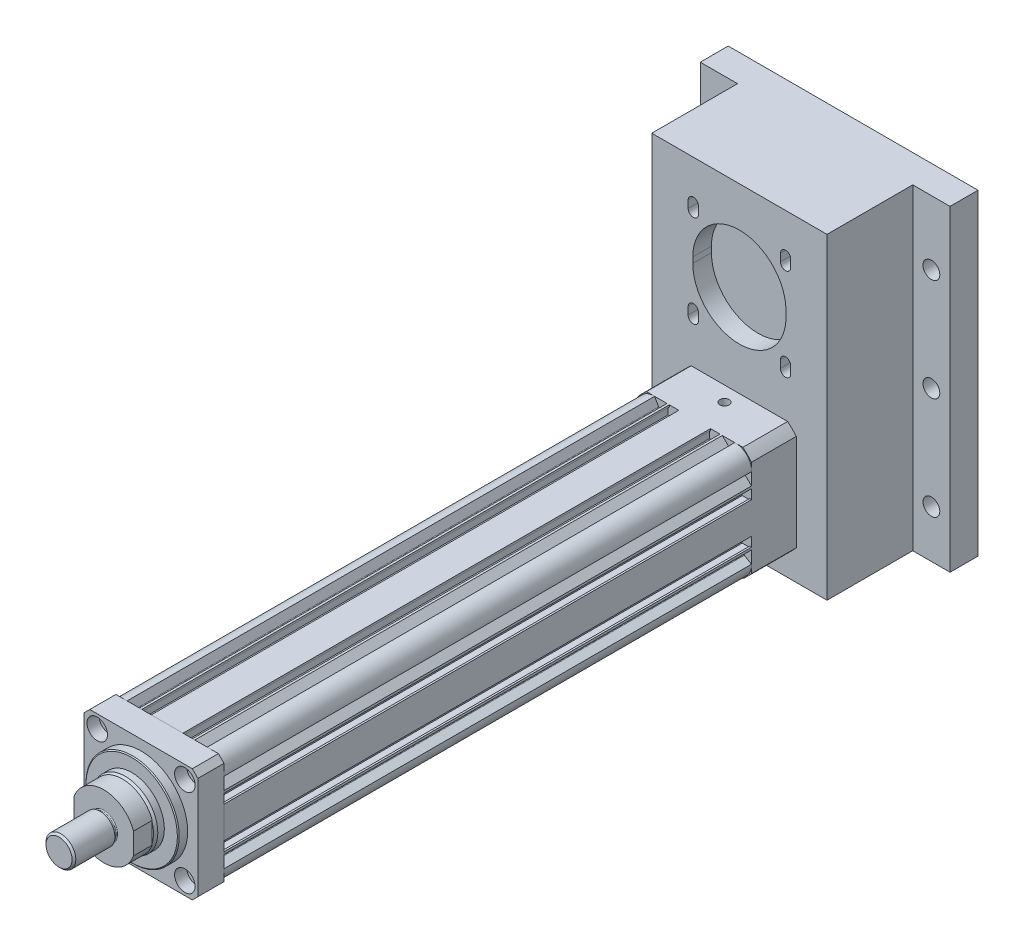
from build123d import *

# Parameters (mm, degrees)
SKETCH_1_R           = 25
SKETCH_1_R_2         = 2.594
EXTRUDE_1_DEPTH      = 283
EXTRUDE_1_2_DEPTH    = 14
SKETCH_3_R           = 4.5
SKETCH_3_R_2         = 3.5
CUT_EXTRUDE_3_DEPTH  = 14
SKETCH_3_5_R         = 5.5
CUT_EXTRUDE_4_DEPTH  = 6.5
SKETCH_5_R           = 25
EXTRUDE_2_DEPTH      = 5
CHAMFER_1_SIZE       = 0.5
SKETCH_6_R           = 17.5
EXTRUDE_3_DEPTH      = 5
CHAMFER_2_SIZE       = 1.5
CHAMFER_2_SIZE2      = 0.8
EXTRUDE_4_DEPTH      = 10
SKETCH_8_R           = 7
EXTRUDE_5_DEPTH      = 2
SKETCH_9_R           = 8
EXTRUDE_6_DEPTH      = 22
CHAMFER_3_SIZE       = 1
FILLET_1_R           = 0.5
SKETCH_10_W          = 61
SKETCH_10_H          = 61
EXTRUDE_7_DEPTH      = 24
SKETCH_11_R          = 50
SKETCH_11_R_2        = 40
CUT_EXTRUDE_1_DEPTH  = 24
SKETCH_26_W          = 94
SKETCH_26_H          = 170
EXTRUDE_11_DEPTH     = 46
CUT_EXTRUDE_11_DEPTH = 10
CUT_EXTRUDE_12_DEPTH = 10
CUT_EXTRUDE_START    = -10
CUT_EXTRUDE_13_DEPTH = 5
SKETCH_28_W          = 134
SKETCH_28_H          = 170
SKETCH_28_R          = 4.5
EXTRUDE_12_DEPTH     = 15


with BuildPart() as part:
    # Sketch 1 → Extrude 1 (new body)
    with BuildSketch(Plane.XY):
        with BuildLine():
            Line((30.5, 8.5), (29.5, 8.5))
            Line((29.5, 8.5), (29.5, 7.9))
            Line((29.5, 7.9), (25.5, 7.9))
            Line((25.5, 7.9), (25.5, 14.2))
            Line((25.5, 14.2), (29.5, 14.2))
            Line((29.5, 14.2), (29.5, 13.6))
            Line((29.5, 13.6), (30.5, 13.6))
            Line((30.5, 13.6), (30.5, 14.843551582))
            Line((30.5, 14.843551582), (26.602512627, 18.741038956))
            ThreePointArc((26.602512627, 18.741038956), (26.502994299, 19.034210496), (26.675, 19.29163522))
            Line((26.675, 19.29163522), (30.5, 21.5))
            ThreePointArc((30.5, 21.5), (28.010599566, 28.010599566), (21.5, 30.5))
            Line((21.5, 30.5), (19.29163522, 26.675))
            ThreePointArc((19.29163522, 26.675), (19.034210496, 26.502994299), (18.741038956, 26.602512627))
            Line((18.741038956, 26.602512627), (14.843551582, 30.5))
            Line((14.843551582, 30.5), (13.6, 30.5))
            Line((13.6, 30.5), (13.6, 29.5))
            Line((13.6, 29.5), (14.2, 29.5))
            Line((14.2, 29.5), (14.2, 25.5))
            Line((14.2, 25.5), (7.9, 25.5))
            Line((7.9, 25.5), (7.9, 29.5))
            Line((7.9, 29.5), (8.5, 29.5))
            Line((8.5, 29.5), (8.5, 30.5))
            Line((8.5, 30.5), (-8.5, 30.5))
            Line((-8.5, 30.5), (-8.5, 29.5))
            Line((-8.5, 29.5), (-7.9, 29.5))
            Line((-7.9, 29.5), (-7.9, 25.5))
            Line((-7.9, 25.5), (-14.2, 25.5))
            Line((-14.2, 25.5), (-14.2, 29.5))
            Line((-14.2, 29.5), (-13.6, 29.5))
            Line((-13.6, 29.5), (-13.6, 30.5))
            Line((-13.6, 30.5), (-14.843551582, 30.5))
            Line((-14.843551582, 30.5), (-18.741038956, 26.602512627))
            ThreePointArc((-18.741038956, 26.602512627), (-19.034210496, 26.502994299), (-19.29163522, 26.675))
            Line((-19.29163522, 26.675), (-21.5, 30.5))
            ThreePointArc((-21.5, 30.5), (-28.010599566, 28.010599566), (-30.5, 21.5))
            Line((-30.5, 21.5), (-26.675, 19.29163522))
            ThreePointArc((-26.675, 19.29163522), (-26.502994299, 19.034210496), (-26.602512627, 18.741038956))
            Line((-26.602512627, 18.741038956), (-30.5, 14.843551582))
            Line((-30.5, 14.843551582), (-30.5, 13.6))
            Line((-30.5, 13.6), (-29.5, 13.6))
            Line((-29.5, 13.6), (-29.5, 14.2))
            Line((-29.5, 14.2), (-25.5, 14.2))
            Line((-25.5, 14.2), (-25.5, 7.9))
            Line((-25.5, 7.9), (-29.5, 7.9))
            Line((-29.5, 7.9), (-29.5, 8.5))
            Line((-29.5, 8.5), (-30.5, 8.5))
            Line((-30.5, 8.5), (-30.5, -8.5))
            Line((-30.5, -8.5), (-29.5, -8.5))
            Line((-29.5, -8.5), (-29.5, -7.9))
            Line((-29.5, -7.9), (-25.5, -7.9))
            Line((-25.5, -7.9), (-25.5, -14.2))
            Line((-25.5, -14.2), (-29.5, -14.2))
            Line((-29.5, -14.2), (-29.5, -13.6))
            Line((-29.5, -13.6), (-30.5, -13.6))
            Line((-30.5, -13.6), (-30.5, -14.843551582))
            Line((-30.5, -14.843551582), (-26.602512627, -18.741038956))
            ThreePointArc((-26.602512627, -18.741038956), (-26.502994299, -19.034210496), (-26.675, -19.29163522))
            Line((-26.675, -19.29163522), (-30.5, -21.5))
            ThreePointArc((-30.5, -21.5), (-27.825897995, -28.191225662), (-21, -30.5))
            Line((-21, -30.5), (-18.79163522, -26.675))
            ThreePointArc((-18.79163522, -26.675), (-18.534210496, -26.502994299), (-18.241038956, -26.602512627))
            Line((-18.241038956, -26.602512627), (-14.343551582, -30.5))
            Line((-14.343551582, -30.5), (14.343551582, -30.5))
            Line((14.343551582, -30.5), (18.241038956, -26.602512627))
            ThreePointArc((18.241038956, -26.602512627), (18.534210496, -26.502994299), (18.79163522, -26.675))
            Line((18.79163522, -26.675), (21, -30.5))
            ThreePointArc((21, -30.5), (27.825897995, -28.191225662), (30.5, -21.5))
            Line((30.5, -21.5), (26.675, -19.29163522))
            ThreePointArc((26.675, -19.29163522), (26.502994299, -19.034210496), (26.602512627, -18.741038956))
            Line((26.602512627, -18.741038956), (30.5, -14.843551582))
            Line((30.5, -14.843551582), (30.5, -13.6))
            Line((30.5, -13.6), (29.5, -13.6))
            Line((29.5, -13.6), (29.5, -14.2))
            Line((29.5, -14.2), (25.5, -14.2))
            Line((25.5, -14.2), (25.5, -7.9))
            Line((25.5, -7.9), (29.5, -7.9))
            Line((29.5, -7.9), (29.5, -8.5))
            Line((29.5, -8.5), (30.5, -8.5))
            Line((30.5, -8.5), (30.5, 8.5))
        make_face()
        Circle(SKETCH_1_R, mode=Mode.SUBTRACT)
        with Locations((23.5, -23.5)):
            Circle(SKETCH_1_R_2, mode=Mode.SUBTRACT)
        with Locations((-23.5, -23.5)):
            Circle(SKETCH_1_R_2, mode=Mode.SUBTRACT)
        with Locations((23.5, 23.5)):
            Circle(SKETCH_1_R_2, mode=Mode.SUBTRACT)
        with Locations((-23.5, 23.5)):
            Circle(SKETCH_1_R_2, mode=Mode.SUBTRACT)
        with BuildLine():
            Line((-14.843484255, -26.551505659), (-5.699422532, -26.551505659))
            ThreePointArc((-5.699422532, -26.551505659), (-5.401016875, -26.282393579), (-5.637974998, -25.957866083))
            ThreePointArc((-5.637974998, -25.957866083), (-10.496775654, -24.470016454), (-15.006657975, -22.128520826))
            ThreePointArc((-15.006657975, -22.128520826), (-15.31244973, -22.117932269), (-15.468484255, -22.381131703))
            Line((-15.468484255, -22.381131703), (-15.468484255, -25.926505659))
            Line((-15.468484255, -25.926505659), (-14.843484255, -26.551505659))
        make_face(mode=Mode.SUBTRACT)
        with BuildLine():
            Line((15.037740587, -26.551505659), (5.893678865, -26.551505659))
            ThreePointArc((5.893678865, -26.551505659), (5.595273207, -26.282393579), (5.832231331, -25.957866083))
            ThreePointArc((5.832231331, -25.957866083), (10.691031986, -24.470016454), (15.200914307, -22.128520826))
            ThreePointArc((15.200914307, -22.128520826), (15.506706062, -22.117932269), (15.662740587, -22.381131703))
            Line((15.662740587, -22.381131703), (15.662740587, -25.926505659))
            Line((15.662740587, -25.926505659), (15.037740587, -26.551505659))
        make_face(mode=Mode.SUBTRACT)
        with BuildLine():
            Line((24.057261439, -13.884764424), (23.358946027, -13.481591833))
            ThreePointArc((23.358946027, -13.481591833), (23.055418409, -13.441631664), (22.812535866, -13.628001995))
            Line((22.812535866, -13.628001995), (21.480305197, -15.935493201))
            ThreePointArc((21.480305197, -15.935493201), (21.440345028, -16.239020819), (21.626715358, -16.481903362))
            Line((21.626715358, -16.481903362), (22.892186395, -17.212523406))
            ThreePointArc((22.892186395, -17.212523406), (23.195714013, -17.252483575), (23.438596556, -17.066113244))
            Line((23.438596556, -17.066113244), (24.274264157, -15.618694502))
            ThreePointArc((24.274264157, -15.618694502), (24.317966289, -15.507082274), (24.326638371, -15.387533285))
            Line((24.326638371, -15.387533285), (24.223757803, -14.070923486))
            ThreePointArc((24.223757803, -14.070923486), (24.155411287, -13.964516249), (24.057261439, -13.884764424))
        make_face(mode=Mode.SUBTRACT)
        with BuildLine():
            Line((-24.057261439, -13.884764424), (-23.358946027, -13.481591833))
            ThreePointArc((-23.358946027, -13.481591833), (-23.055418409, -13.441631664), (-22.812535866, -13.628001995))
            Line((-22.812535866, -13.628001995), (-21.480305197, -15.935493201))
            ThreePointArc((-21.480305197, -15.935493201), (-21.440345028, -16.239020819), (-21.626715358, -16.481903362))
            Line((-21.626715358, -16.481903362), (-22.892186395, -17.212523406))
            ThreePointArc((-22.892186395, -17.212523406), (-23.195714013, -17.252483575), (-23.438596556, -17.066113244))
            Line((-23.438596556, -17.066113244), (-24.274264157, -15.618694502))
            ThreePointArc((-24.274264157, -15.618694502), (-24.317966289, -15.507082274), (-24.326638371, -15.387533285))
            Line((-24.326638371, -15.387533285), (-24.223757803, -14.070923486))
            ThreePointArc((-24.223757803, -14.070923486), (-24.155411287, -13.964516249), (-24.057261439, -13.884764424))
        make_face(mode=Mode.SUBTRACT)
        with BuildLine():
            Line((24.057261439, 13.884764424), (23.358946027, 13.481591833))
            ThreePointArc((23.358946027, 13.481591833), (23.055418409, 13.441631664), (22.812535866, 13.628001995))
            Line((22.812535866, 13.628001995), (21.480305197, 15.935493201))
            ThreePointArc((21.480305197, 15.935493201), (21.440345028, 16.239020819), (21.626715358, 16.481903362))
            Line((21.626715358, 16.481903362), (22.892186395, 17.212523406))
            ThreePointArc((22.892186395, 17.212523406), (23.195714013, 17.252483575), (23.438596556, 17.066113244))
            Line((23.438596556, 17.066113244), (24.274264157, 15.618694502))
            ThreePointArc((24.274264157, 15.618694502), (24.317966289, 15.507082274), (24.326638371, 15.387533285))
            Line((24.326638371, 15.387533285), (24.223757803, 14.070923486))
            ThreePointArc((24.223757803, 14.070923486), (24.155411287, 13.964516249), (24.057261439, 13.884764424))
        make_face(mode=Mode.SUBTRACT)
        with BuildLine():
            Line((-24.057261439, 13.884764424), (-23.358946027, 13.481591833))
            ThreePointArc((-23.358946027, 13.481591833), (-23.055418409, 13.441631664), (-22.812535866, 13.628001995))
            Line((-22.812535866, 13.628001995), (-21.480305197, 15.935493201))
            ThreePointArc((-21.480305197, 15.935493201), (-21.440345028, 16.239020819), (-21.626715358, 16.481903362))
            Line((-21.626715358, 16.481903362), (-22.892186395, 17.212523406))
            ThreePointArc((-22.892186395, 17.212523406), (-23.195714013, 17.252483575), (-23.438596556, 17.066113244))
            Line((-23.438596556, 17.066113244), (-24.274264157, 15.618694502))
            ThreePointArc((-24.274264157, 15.618694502), (-24.317966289, 15.507082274), (-24.326638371, 15.387533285))
            Line((-24.326638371, 15.387533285), (-24.223757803, 14.070923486))
            ThreePointArc((-24.223757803, 14.070923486), (-24.155411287, 13.964516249), (-24.057261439, 13.884764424))
        make_face(mode=Mode.SUBTRACT)
        with BuildLine():
            Line((17.761634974, 23.75411276), (17.07315308, 24.68624059))
            ThreePointArc((17.07315308, 24.68624059), (16.934629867, 24.812286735), (16.758415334, 24.87572765))
            Line((16.758415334, 24.87572765), (13.966108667, 25.295529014))
            ThreePointArc((13.966108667, 25.295529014), (13.689318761, 25.25468305), (13.482325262, 25.066441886))
            Line((13.482325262, 25.066441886), (12.839111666, 23.986237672))
            ThreePointArc((12.839111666, 23.986237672), (12.785382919, 23.626185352), (12.999780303, 23.331977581))
            ThreePointArc((12.999780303, 23.331977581), (14.833000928, 22.112125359), (16.576342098, 20.766949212))
            ThreePointArc((16.576342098, 20.766949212), (17.053890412, 20.688035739), (17.357364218, 21.065107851))
            Line((17.357364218, 21.065107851), (17.761634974, 23.75411276))
        make_face(mode=Mode.SUBTRACT)
        with BuildLine():
            Line((-17.761634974, 23.75411276), (-17.07315308, 24.68624059))
            ThreePointArc((-17.07315308, 24.68624059), (-16.934629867, 24.812286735), (-16.758415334, 24.87572765))
            Line((-16.758415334, 24.87572765), (-13.966108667, 25.295529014))
            ThreePointArc((-13.966108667, 25.295529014), (-13.689318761, 25.25468305), (-13.482325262, 25.066441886))
            Line((-13.482325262, 25.066441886), (-12.839111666, 23.986237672))
            ThreePointArc((-12.839111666, 23.986237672), (-12.785382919, 23.626185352), (-12.999780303, 23.331977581))
            ThreePointArc((-12.999780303, 23.331977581), (-14.833000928, 22.112125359), (-16.576342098, 20.766949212))
            ThreePointArc((-16.576342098, 20.766949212), (-17.053890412, 20.688035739), (-17.357364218, 21.065107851))
            Line((-17.357364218, 21.065107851), (-17.761634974, 23.75411276))
        make_face(mode=Mode.SUBTRACT)
    extrude(amount=EXTRUDE_1_DEPTH)

    # Sketch 10 → Extrude 7 (add)
    with BuildSketch(Plane(origin=(0, 0, 0), x_dir=(-1, 0, 0), z_dir=(0, 0, -1))):
        Rectangle(SKETCH_10_W, SKETCH_10_H)
    extrude(amount=EXTRUDE_7_DEPTH)

    # Sketch 11 → Cut-Extrude 1 (cut)
    with BuildSketch(Plane(origin=(0, 0, -24), x_dir=(-1, 0, 0), z_dir=(0, 0, -1))):
        Circle(SKETCH_11_R)
        Circle(SKETCH_11_R_2, mode=Mode.SUBTRACT)
    extrude(amount=-CUT_EXTRUDE_1_DEPTH, mode=Mode.SUBTRACT)

    # Sketch 15 → Hole Wizard M6 _1 (revolve, cut)
    with BuildSketch(Plane(origin=(0, 30.5, -16), x_dir=(0, 0, 1), z_dir=(1, 0, 0))):
        Polygon((0, 0), (0, 9.502151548), (2.5, 8), (2.5, 0), align=None)
    revolve(axis=Axis((0, 36.85, -16), (0, -1, 0)), mode=Mode.SUBTRACT)

    # Sketch 26 → Extrude 11 (add)
    with BuildSketch(Plane(origin=(0, 0, -24), x_dir=(-1, 0, 0), z_dir=(0, 0, -1))):
        with Locations((0, 43)):
            Rectangle(SKETCH_26_W, SKETCH_26_H)
    extrude(amount=EXTRUDE_11_DEPTH)

    # Sketch 27 → Cut-Extrude 11 (cut)
    with BuildSketch(Plane.XY.offset(-24)):
        with BuildLine():
            Line((-25, 81.5), (-24.999999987, 78.49920032))
            ThreePointArc((-24.999999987, 78.49920032), (0.00039984, 53.500000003), (25, 78.5))
            Line((25, 78.5), (25, 81.5))
            ThreePointArc((25, 81.5), (0, 106.5), (-25, 81.5))
        make_face()
    extrude(amount=-CUT_EXTRUDE_11_DEPTH, mode=Mode.SUBTRACT)

    # Sketch 27_3 → Cut-Extrude 12 (cut)
    with BuildSketch(Plane.XY.offset(-24)):
        with BuildLine():
            Line((-27.498737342, 102.748737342), (-27.498737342, 106.748737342))
            ThreePointArc((-27.498737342, 106.748737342), (-24.748737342, 109.498737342), (-21.998737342, 106.748737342))
            Line((-21.998737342, 106.748737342), (-21.998737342, 102.748737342))
            ThreePointArc((-21.998737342, 102.748737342), (-24.748737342, 99.998737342), (-27.498737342, 102.748737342))
        make_face()
        with BuildLine():
            Line((27.498737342, 102.748737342), (27.498737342, 106.748737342))
            ThreePointArc((27.498737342, 106.748737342), (24.748737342, 109.498737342), (21.998737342, 106.748737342))
            Line((21.998737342, 106.748737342), (21.998737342, 102.748737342))
            ThreePointArc((21.998737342, 102.748737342), (24.748737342, 99.998737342), (27.498737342, 102.748737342))
        make_face()
        with BuildLine():
            Line((27.498737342, 57.251262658), (27.498737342, 53.251262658))
            ThreePointArc((27.498737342, 53.251262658), (24.748737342, 50.501262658), (21.998737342, 53.251262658))
            Line((21.998737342, 53.251262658), (21.998737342, 57.251262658))
            ThreePointArc((21.998737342, 57.251262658), (24.748737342, 60.001262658), (27.498737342, 57.251262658))
        make_face()
        with BuildLine():
            Line((-27.498737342, 57.251262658), (-27.498737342, 53.251262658))
            ThreePointArc((-27.498737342, 53.251262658), (-24.748737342, 50.501262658), (-21.998737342, 53.251262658))
            Line((-21.998737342, 53.251262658), (-21.998737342, 57.251262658))
            ThreePointArc((-21.998737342, 57.251262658), (-24.748737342, 60.001262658), (-27.498737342, 57.251262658))
        make_face()
    extrude(amount=-CUT_EXTRUDE_12_DEPTH, mode=Mode.SUBTRACT)

    # Sketch 27_4 → Cut-Extrude 13 (cut)
    with BuildSketch(Plane.XY.offset(-24).offset(CUT_EXTRUDE_START)):
        with BuildLine():
            Line((-28.848737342, 101.848737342), (-28.848737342, 107.648737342))
            ThreePointArc((-28.848737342, 107.648737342), (-24.748737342, 111.748737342), (-20.648737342, 107.648737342))
            Line((-20.648737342, 107.648737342), (-20.648737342, 101.848737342))
            ThreePointArc((-20.648737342, 101.848737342), (-24.748737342, 97.748737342), (-28.848737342, 101.848737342))
        make_face()
        with BuildLine():
            Line((28.848737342, 101.848737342), (28.848737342, 107.648737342))
            ThreePointArc((28.848737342, 107.648737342), (24.748737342, 111.748737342), (20.648737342, 107.648737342))
            Line((20.648737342, 107.648737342), (20.648737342, 101.848737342))
            ThreePointArc((20.648737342, 101.848737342), (24.748737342, 97.748737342), (28.848737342, 101.848737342))
        make_face()
        with BuildLine():
            Line((28.848737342, 58.151262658), (28.848737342, 52.351262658))
            ThreePointArc((28.848737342, 52.351262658), (24.748737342, 48.251262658), (20.648737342, 52.351262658))
            Line((20.648737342, 52.351262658), (20.648737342, 58.151262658))
            ThreePointArc((20.648737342, 58.151262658), (24.748737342, 62.251262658), (28.848737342, 58.151262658))
        make_face()
        with BuildLine():
            Line((-28.848737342, 58.151262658), (-28.848737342, 52.351262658))
            ThreePointArc((-28.848737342, 52.351262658), (-24.748737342, 48.251262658), (-20.648737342, 52.351262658))
            Line((-20.648737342, 52.351262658), (-20.648737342, 58.151262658))
            ThreePointArc((-20.648737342, 58.151262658), (-24.748737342, 62.251262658), (-28.848737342, 58.151262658))
        make_face()
    extrude(amount=-CUT_EXTRUDE_13_DEPTH, mode=Mode.SUBTRACT)

    # Sketch 28 → Extrude 12 (add)
    with BuildSketch(Plane(origin=(0, 0, -70), x_dir=(-1, 0, 0), z_dir=(0, 0, -1))):
        with Locations((0, 43)):
            Rectangle(SKETCH_28_W, SKETCH_28_H)
        with Locations((-57, 93.5)):
            Circle(SKETCH_28_R, mode=Mode.SUBTRACT)
        with Locations((-57, 38.5)):
            Circle(SKETCH_28_R, mode=Mode.SUBTRACT)
        with Locations((-57, -16.5)):
            Circle(SKETCH_28_R, mode=Mode.SUBTRACT)
        with Locations(Location((57, -16.5, 0), (0, 0, 180))):
            Circle(SKETCH_28_R, mode=Mode.SUBTRACT)
        with Locations(Location((57, 38.5, 0), (0, 0, 180))):
            Circle(SKETCH_28_R, mode=Mode.SUBTRACT)
        with Locations(Location((57, 93.5, 0), (0, 0, 180))):
            Circle(SKETCH_28_R, mode=Mode.SUBTRACT)
    extrude(amount=EXTRUDE_12_DEPTH)


with BuildPart() as body_2:
    # Sketch 2 → Extrude 1 2 (new body)
    with BuildSketch(Plane.XY.offset(283)):
        Polygon((-27.5, 30.5), (-30.5, 27.5), (-30.5, -27.5), (-27.5, -30.5), (27.5, -30.5), (30.5, -27.5), (30.5, 27.5), (27.5, 30.5), align=None)
    extrude(amount=EXTRUDE_1_2_DEPTH)

    # Sketch 3 → Cut-Extrude 3 (cut)
    with BuildSketch(Plane.XY.offset(297)):
        with Locations((-40, -20)):
            Circle(SKETCH_3_R)
        with Locations((-23.5, -23.5)):
            Circle(SKETCH_3_R_2)
        with Locations((-23.5, 23.5)):
            Circle(SKETCH_3_R_2)
        with Locations((23.5, 23.5)):
            Circle(SKETCH_3_R_2)
        with Locations((40, 20)):
            Circle(SKETCH_3_R)
        with Locations((40, -20)):
            Circle(SKETCH_3_R)
        with Locations((23.5, -23.5)):
            Circle(SKETCH_3_R_2)
        with Locations((-40, 20)):
            Circle(SKETCH_3_R)
    extrude(amount=-CUT_EXTRUDE_3_DEPTH, mode=Mode.SUBTRACT)

    # Sketch 3_5 → Cut-Extrude 4 (cut)
    with BuildSketch(Plane.XY.offset(297)):
        with Locations((-23.5, 23.5)):
            Circle(SKETCH_3_5_R)
        with Locations((-23.5, -23.5)):
            Circle(SKETCH_3_5_R)
        with Locations((23.5, -23.5)):
            Circle(SKETCH_3_5_R)
        with Locations((23.5, 23.5)):
            Circle(SKETCH_3_5_R)
    extrude(amount=-CUT_EXTRUDE_4_DEPTH, mode=Mode.SUBTRACT)

    # Sketch 5 → Extrude 2 (add)
    with BuildSketch(Plane.XY.offset(297)):
        Circle(SKETCH_5_R)
    extrude(amount=EXTRUDE_2_DEPTH)

    # Chamfer 1
    chamfer_1_edges = [body_2.edges().sort_by_distance(p)[0] for p in [
        (-25, 0, 302),
    ]]
    chamfer(chamfer_1_edges, length=CHAMFER_1_SIZE)

    # Sketch 6 → Extrude 3 (add)
    with BuildSketch(Plane.XY.offset(302)):
        Circle(SKETCH_6_R)
    extrude(amount=EXTRUDE_3_DEPTH)

    # Chamfer 2
    chamfer_2_edges = [body_2.edges().sort_by_distance(p)[0] for p in [
        (-17.5, 0, 307),
    ]]
    chamfer_2_side = [body_2.faces().sort_by_distance(p)[0] for p in [
        (-17.5, 0, 304.5),
    ]]
    chamfer(chamfer_2_edges, length=CHAMFER_2_SIZE, length2=CHAMFER_2_SIZE2, reference=chamfer_2_side[0])

    # Sketch 7 → Extrude 4 (add)
    with BuildSketch(Plane.XY.offset(307)):
        with BuildLine():
            Line((-16, 5.744562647), (-16, -5.744562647))
            ThreePointArc((-16, -5.744562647), (0, -17), (16, -5.744562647))
            Line((16, -5.744562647), (16, 5.744562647))
            ThreePointArc((16, 5.744562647), (0, 17), (-16, 5.744562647))
        make_face()
    extrude(amount=EXTRUDE_4_DEPTH)

    # Sketch 8 → Extrude 5 (add)
    with BuildSketch(Plane.XY.offset(317)):
        Circle(SKETCH_8_R)
    extrude(amount=EXTRUDE_5_DEPTH)

    # Sketch 9 → Extrude 6 (add)
    with BuildSketch(Plane.XY.offset(319)):
        Circle(SKETCH_9_R)
    extrude(amount=EXTRUDE_6_DEPTH)

    # Chamfer 3
    chamfer_3_edges = [body_2.edges().sort_by_distance(p)[0] for p in [
        (-8, 0, 341),
    ]]
    chamfer(chamfer_3_edges, length=CHAMFER_3_SIZE)

    # Fillet 1
    fillet_1_edges = [body_2.edges().sort_by_distance(p)[0] for p in [
        (-7, 0, 317),
    ]]
    fillet(fillet_1_edges, radius=FILLET_1_R)


solid = Compound([part.part, body_2.part])
